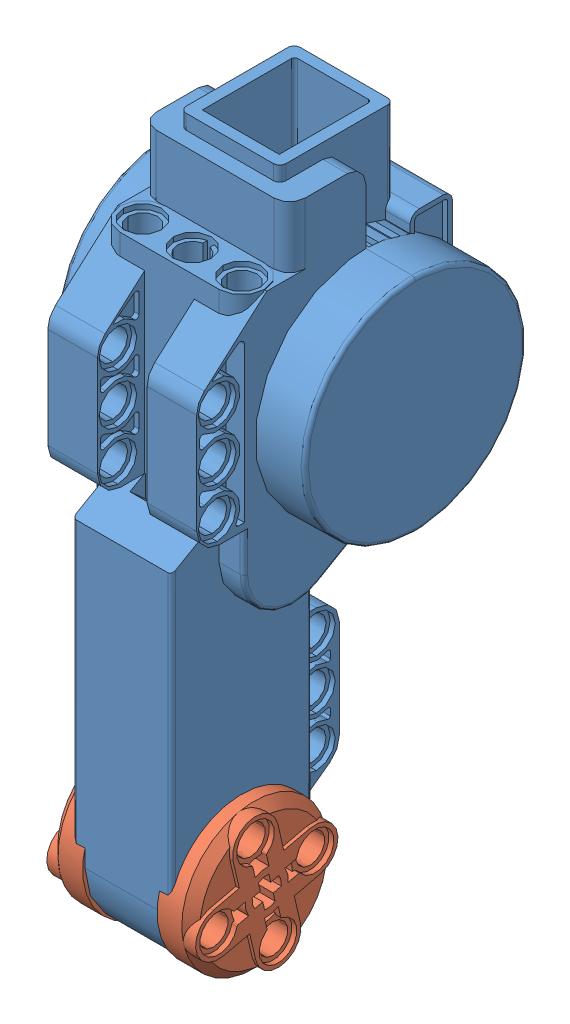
SolidWorks assembly nxt_motor.SLDASM, configuration Default (file format 3100). Lengths in mm.
Overall size (40.3 111.21 48.34).
3 component instances, 2 part files, 5 mates.
Components (placement in the parent):
- nxt_motor-1: nxt_motor.SLDPRT [Default] at (-1.3779 -24.5189 17.3849) size (40.3 108.45 45.65)
- nxt_motor_wheel-1: nxt_motor_wheel.SLDPRT [Default] at (4.6721 -24.5189 17.3849) x (0 -0.227455 0.973789) z (1 0 0) size (23.57 23.57 6.05)
- nxt_motor_wheel-2: nxt_motor_wheel.SLDPRT [Default] at (-7.4279 -24.5189 17.3849) x (0 0.227455 -0.973789) z (-1 0 0) size (23.57 23.57 6.05)
Mates (geometry in assembly coordinates):
- Parallel1: parallel: plane of nxt_motor_wheel-1 through (4.5511 -23.8566 18.3964) normal (0 -0.973789 -0.227455); plane of nxt_motor_wheel-2 through (-33.3324 -24.182 19.7893) normal (0 -0.973789 -0.227455)
- Concentric1: concentric aligned: cylinder of nxt_motor-1; cylinder of nxt_motor_wheel-1
- Concentric2: concentric anti-aligned: cylinder of nxt_motor-1; cylinder of nxt_motor_wheel-2
- Coincident1: coincident anti-aligned: plane of nxt_motor-1; plane of nxt_motor_wheel-1
- Coincident2: coincident anti-aligned: plane of nxt_motor-1; plane of nxt_motor_wheel-2
